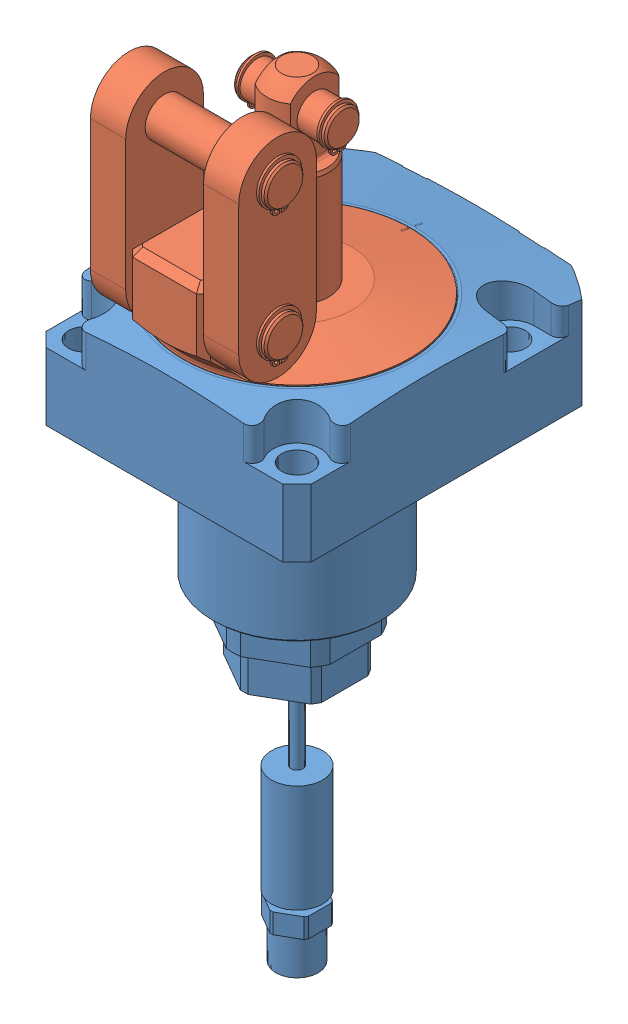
SolidWorks assembly ilc16322200US.SLDASM, configuration Default (file format 13000). Lengths in mm.
Overall size (75 225.71 87.5).
2 component instances, 2 part files, 3 mates.
Components (placement in the parent):
- ilc16322200US_BODY-1: ilc16322200US_BODY.SLDPRT [Default] at origin size (75 163.55 87.5)
- ilc16322200US_LUG-1: ilc16322200US_LUG.SLDPRT [Default] at (0 19.9898 0) size (63.93 72.5 69.47)
Mates (geometry in assembly coordinates):
- Coincident1: coincident anti-aligned: plane of ilc16322200US_BODY-1 through (32.015 19.9898 0) normal (0 1 0); plane of ilc16322200_LUG-1 through (-11 19.9898 0) normal (0 -1 0)
- Concentric1: concentric anti-aligned: cylinder of ilc16322200US_BODY-1 through (0 -8.9689 0) axis (0 -1 0) radius 32.015; cylinder of ilc16322200_LUG-1 through (0 36.6211 0) axis (0 1 0) radius 31.9659
- LUG ANGLE: planar angle = 3.141593 rad anti-aligned: plane of ilc16322200_LUG-1 through (0 19.9898 0) normal (1 0 0)
